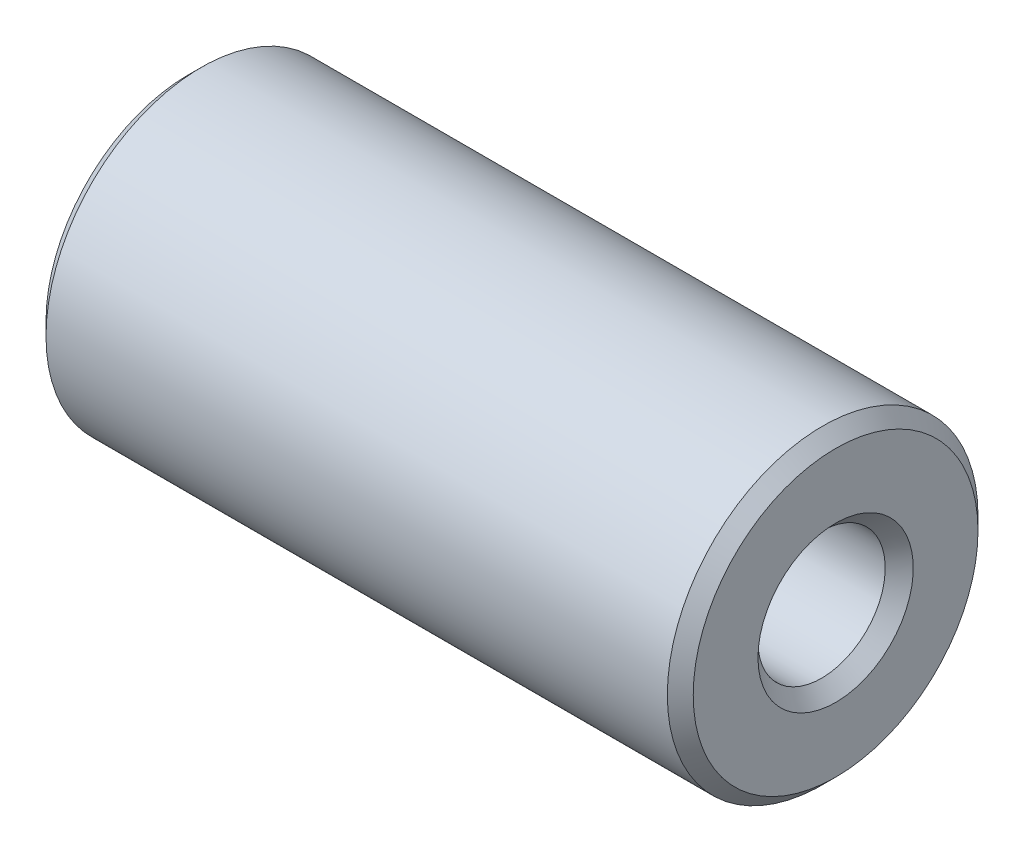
ISO-10303-21;
HEADER;
FILE_DESCRIPTION(('STEP AP214'),'2;1');
FILE_NAME('part.step','',(''),(''),'','','');
FILE_SCHEMA(('AUTOMOTIVE_DESIGN { 1 0 10303 214 1 1 1 1 }'));
ENDSEC;
DATA;
#1=APPLICATION_CONTEXT('core data for automotive mechanical design processes');
#2=APPLICATION_PROTOCOL_DEFINITION('international standard','automotive_design',2000,#1);
#3=PRODUCT_CONTEXT('',#1,'mechanical');
#4=PRODUCT('Part','Part','',(#3));
#5=PRODUCT_RELATED_PRODUCT_CATEGORY('part','',(#4));
#6=PRODUCT_DEFINITION_FORMATION('','',#4);
#7=PRODUCT_DEFINITION_CONTEXT('part definition',#1,'design');
#8=PRODUCT_DEFINITION('design','',#6,#7);
#9=PRODUCT_DEFINITION_SHAPE('','',#8);
#10=(LENGTH_UNIT() NAMED_UNIT(*) SI_UNIT(.MILLI.,.METRE.));
#11=(NAMED_UNIT(*) PLANE_ANGLE_UNIT() SI_UNIT($,.RADIAN.));
#12=(NAMED_UNIT(*) SI_UNIT($,.STERADIAN.) SOLID_ANGLE_UNIT());
#13=UNCERTAINTY_MEASURE_WITH_UNIT(LENGTH_MEASURE(1.E-05),#10,'distance_accuracy_value','');
#14=(GEOMETRIC_REPRESENTATION_CONTEXT(3) GLOBAL_UNCERTAINTY_ASSIGNED_CONTEXT((#13)) GLOBAL_UNIT_ASSIGNED_CONTEXT((#10,
#11,#12)) REPRESENTATION_CONTEXT('',''));
#15=CARTESIAN_POINT('',(0.,0.,0.));
#16=DIRECTION('',(0.,0.,1.));
#17=DIRECTION('',(1.,0.,0.));
#18=AXIS2_PLACEMENT_3D('',#15,#16,#17);
#19=CARTESIAN_POINT('',(24.9999999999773,5.50000000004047,0.));
#20=DIRECTION('',(1.,0.,0.));
#21=DIRECTION('',(0.,0.,-1.));
#22=AXIS2_PLACEMENT_3D('',#19,#20,#21);
#23=PLANE('',#22);
#24=CARTESIAN_POINT('',(24.9999999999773,0.,0.));
#25=DIRECTION('',(-1.,0.,0.));
#26=DIRECTION('',(0.,0.,1.));
#27=AXIS2_PLACEMENT_3D('',#24,#25,#26);
#28=CIRCLE('',#27,2.99999999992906);
#29=CARTESIAN_POINT('',(24.9999999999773,0.,2.99999999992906));
#30=VERTEX_POINT('',#29);
#31=EDGE_CURVE('E10',#30,#30,#28,.T.);
#32=ORIENTED_EDGE('',*,*,#31,.T.);
#33=EDGE_LOOP('',(#32));
#34=FACE_BOUND('',#33,.T.);
#35=CARTESIAN_POINT('',(24.9999999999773,0.,0.));
#36=DIRECTION('',(-1.,0.,0.));
#37=DIRECTION('',(0.,0.,1.));
#38=AXIS2_PLACEMENT_3D('',#35,#36,#37);
#39=CIRCLE('',#38,5.50000000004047);
#40=CARTESIAN_POINT('',(24.9999999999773,0.,5.50000000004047));
#41=VERTEX_POINT('',#40);
#42=EDGE_CURVE('E58',#41,#41,#39,.T.);
#43=ORIENTED_EDGE('',*,*,#42,.F.);
#44=EDGE_LOOP('',(#43));
#45=FACE_BOUND('',#44,.T.);
#46=ADVANCED_FACE('F30',(#34,#45),#23,.T.);
#47=CARTESIAN_POINT('',(24.9999999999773,0.,0.));
#48=DIRECTION('',(1.,0.,0.));
#49=DIRECTION('',(0.,0.,-1.));
#50=AXIS2_PLACEMENT_3D('',#47,#48,#49);
#51=CONICAL_SURFACE('',#50,2.99999999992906,0.78539816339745);
#52=CARTESIAN_POINT('',(24.4584999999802,0.,0.));
#53=DIRECTION('',(-1.,0.,0.));
#54=DIRECTION('',(0.,0.,1.));
#55=AXIS2_PLACEMENT_3D('',#52,#53,#54);
#56=CIRCLE('',#55,2.45849999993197);
#57=CARTESIAN_POINT('',(24.4584999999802,0.,2.45849999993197));
#58=VERTEX_POINT('',#57);
#59=EDGE_CURVE('E36',#58,#58,#56,.T.);
#60=ORIENTED_EDGE('',*,*,#59,.T.);
#61=EDGE_LOOP('',(#60));
#62=FACE_BOUND('',#61,.T.);
#63=ORIENTED_EDGE('',*,*,#31,.F.);
#64=EDGE_LOOP('',(#63));
#65=FACE_BOUND('',#64,.T.);
#66=ADVANCED_FACE('F66',(#62,#65),#51,.F.);
#67=CARTESIAN_POINT('',(24.9999999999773,0.,0.));
#68=DIRECTION('',(-1.,0.,0.));
#69=DIRECTION('',(0.,0.,1.));
#70=AXIS2_PLACEMENT_3D('',#67,#68,#69);
#71=CYLINDRICAL_SURFACE('',#70,2.45849999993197);
#72=CARTESIAN_POINT('',(0.541499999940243,0.,0.));
#73=DIRECTION('',(-1.,0.,0.));
#74=DIRECTION('',(0.,0.,1.));
#75=AXIS2_PLACEMENT_3D('',#72,#73,#74);
#76=CIRCLE('',#75,2.45849999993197);
#77=CARTESIAN_POINT('',(0.541499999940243,0.,2.45849999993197));
#78=VERTEX_POINT('',#77);
#79=EDGE_CURVE('E40',#78,#78,#76,.T.);
#80=ORIENTED_EDGE('',*,*,#79,.T.);
#81=EDGE_LOOP('',(#80));
#82=FACE_BOUND('',#81,.T.);
#83=ORIENTED_EDGE('',*,*,#59,.F.);
#84=EDGE_LOOP('',(#83));
#85=FACE_BOUND('',#84,.T.);
#86=ADVANCED_FACE('F70',(#82,#85),#71,.F.);
#87=CARTESIAN_POINT('',(0.541499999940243,0.,0.));
#88=DIRECTION('',(-1.,0.,0.));
#89=DIRECTION('',(0.,0.,1.));
#90=AXIS2_PLACEMENT_3D('',#87,#88,#89);
#91=CONICAL_SURFACE('',#90,2.45849999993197,0.785398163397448);
#92=CARTESIAN_POINT('',(-5.6843418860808E-11,0.,0.));
#93=DIRECTION('',(-1.,0.,0.));
#94=DIRECTION('',(0.,0.,1.));
#95=AXIS2_PLACEMENT_3D('',#92,#93,#94);
#96=CIRCLE('',#95,2.99999999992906);
#97=CARTESIAN_POINT('',(-5.6843418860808E-11,0.,2.99999999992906));
#98=VERTEX_POINT('',#97);
#99=EDGE_CURVE('E44',#98,#98,#96,.T.);
#100=ORIENTED_EDGE('',*,*,#99,.T.);
#101=EDGE_LOOP('',(#100));
#102=FACE_BOUND('',#101,.T.);
#103=ORIENTED_EDGE('',*,*,#79,.F.);
#104=EDGE_LOOP('',(#103));
#105=FACE_BOUND('',#104,.T.);
#106=ADVANCED_FACE('F74',(#102,#105),#91,.F.);
#107=CARTESIAN_POINT('',(-5.68436488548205E-11,2.99999999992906,0.));
#108=DIRECTION('',(-1.,0.,0.));
#109=DIRECTION('',(0.,0.,1.));
#110=AXIS2_PLACEMENT_3D('',#107,#108,#109);
#111=PLANE('',#110);
#112=CARTESIAN_POINT('',(-5.6843418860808E-11,0.,0.));
#113=DIRECTION('',(-1.,0.,0.));
#114=DIRECTION('',(0.,0.,1.));
#115=AXIS2_PLACEMENT_3D('',#112,#113,#114);
#116=CIRCLE('',#115,5.49999999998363);
#117=CARTESIAN_POINT('',(-5.6843418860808E-11,0.,5.49999999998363));
#118=VERTEX_POINT('',#117);
#119=EDGE_CURVE('E49',#118,#118,#116,.T.);
#120=ORIENTED_EDGE('',*,*,#119,.T.);
#121=EDGE_LOOP('',(#120));
#122=FACE_BOUND('',#121,.T.);
#123=ORIENTED_EDGE('',*,*,#99,.F.);
#124=EDGE_LOOP('',(#123));
#125=FACE_BOUND('',#124,.T.);
#126=ADVANCED_FACE('F81',(#122,#125),#111,.T.);
#127=CARTESIAN_POINT('',(-5.6843418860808E-11,0.,0.));
#128=DIRECTION('',(1.,0.,0.));
#129=DIRECTION('',(0.,0.,-1.));
#130=AXIS2_PLACEMENT_3D('',#127,#128,#129);
#131=CONICAL_SURFACE('',#130,5.49999999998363,0.785398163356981);
#132=CARTESIAN_POINT('',(0.500000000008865,0.,0.));
#133=DIRECTION('',(-1.,0.,0.));
#134=DIRECTION('',(0.,0.,1.));
#135=AXIS2_PLACEMENT_3D('',#132,#133,#134);
#136=CIRCLE('',#135,6.00000000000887);
#137=CARTESIAN_POINT('',(0.500000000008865,0.,6.00000000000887));
#138=VERTEX_POINT('',#137);
#139=EDGE_CURVE('E52',#138,#138,#136,.T.);
#140=ORIENTED_EDGE('',*,*,#139,.T.);
#141=EDGE_LOOP('',(#140));
#142=FACE_BOUND('',#141,.T.);
#143=ORIENTED_EDGE('',*,*,#119,.F.);
#144=EDGE_LOOP('',(#143));
#145=FACE_BOUND('',#144,.T.);
#146=ADVANCED_FACE('F85',(#142,#145),#131,.T.);
#147=CARTESIAN_POINT('',(24.9999999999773,0.,0.));
#148=DIRECTION('',(-1.,0.,0.));
#149=DIRECTION('',(0.,0.,1.));
#150=AXIS2_PLACEMENT_3D('',#147,#148,#149);
#151=CYLINDRICAL_SURFACE('',#150,6.00000000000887);
#152=CARTESIAN_POINT('',(24.5000000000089,0.,0.));
#153=DIRECTION('',(-1.,0.,0.));
#154=DIRECTION('',(0.,0.,1.));
#155=AXIS2_PLACEMENT_3D('',#152,#153,#154);
#156=CIRCLE('',#155,6.00000000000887);
#157=CARTESIAN_POINT('',(24.5000000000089,0.,6.00000000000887));
#158=VERTEX_POINT('',#157);
#159=EDGE_CURVE('E55',#158,#158,#156,.T.);
#160=ORIENTED_EDGE('',*,*,#159,.T.);
#161=EDGE_LOOP('',(#160));
#162=FACE_BOUND('',#161,.T.);
#163=ORIENTED_EDGE('',*,*,#139,.F.);
#164=EDGE_LOOP('',(#163));
#165=FACE_BOUND('',#164,.T.);
#166=ADVANCED_FACE('F89',(#162,#165),#151,.T.);
#167=CARTESIAN_POINT('',(24.5000000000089,0.,0.));
#168=DIRECTION('',(-1.,0.,0.));
#169=DIRECTION('',(0.,0.,1.));
#170=AXIS2_PLACEMENT_3D('',#167,#168,#169);
#171=CONICAL_SURFACE('',#170,6.00000000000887,0.785398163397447);
#172=ORIENTED_EDGE('',*,*,#42,.T.);
#173=EDGE_LOOP('',(#172));
#174=FACE_BOUND('',#173,.T.);
#175=ORIENTED_EDGE('',*,*,#159,.F.);
#176=EDGE_LOOP('',(#175));
#177=FACE_BOUND('',#176,.T.);
#178=ADVANCED_FACE('F62',(#174,#177),#171,.T.);
#179=CLOSED_SHELL('',(#46,#66,#86,#106,#126,#146,#166,#178));
#180=MANIFOLD_SOLID_BREP('B2',#179);
#181=ADVANCED_BREP_SHAPE_REPRESENTATION('',(#18,#180),#14);
#182=SHAPE_DEFINITION_REPRESENTATION(#9,#181);
ENDSEC;
END-ISO-10303-21;
